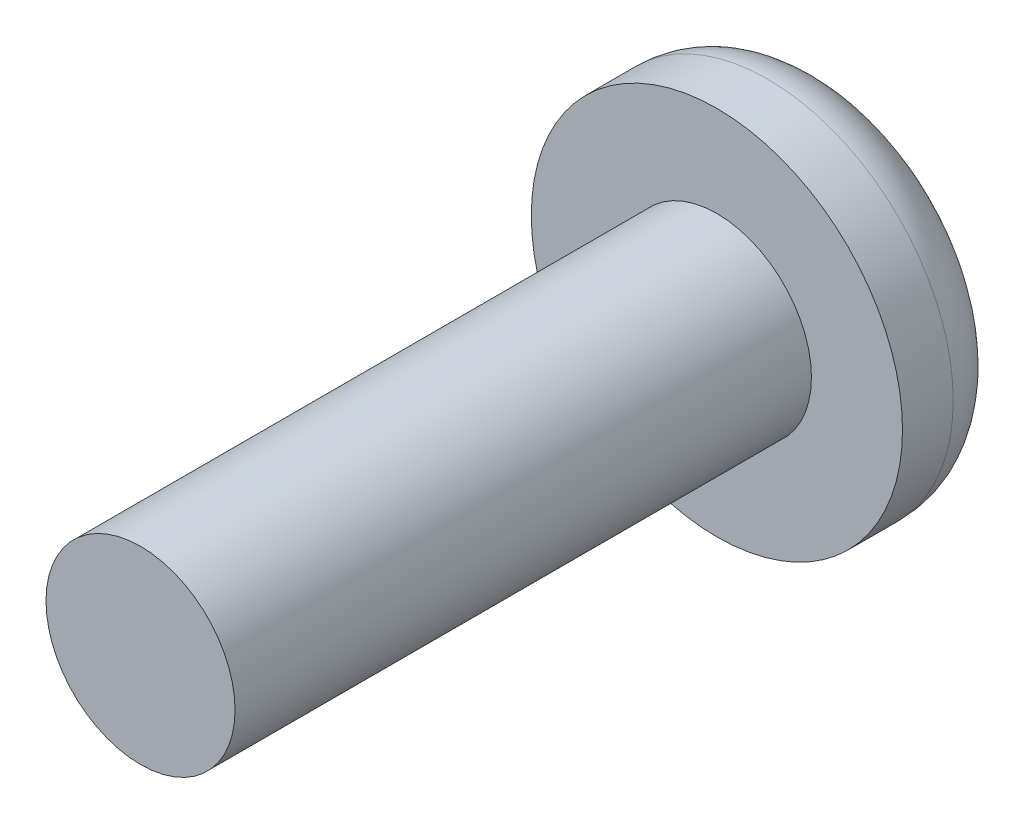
ISO-10303-21;
HEADER;
FILE_DESCRIPTION(('STEP AP214'),'2;1');
FILE_NAME('part.step','',(''),(''),'','','');
FILE_SCHEMA(('AUTOMOTIVE_DESIGN { 1 0 10303 214 1 1 1 1 }'));
ENDSEC;
DATA;
#1=APPLICATION_CONTEXT('core data for automotive mechanical design processes');
#2=APPLICATION_PROTOCOL_DEFINITION('international standard','automotive_design',2000,#1);
#3=PRODUCT_CONTEXT('',#1,'mechanical');
#4=PRODUCT('Part','Part','',(#3));
#5=PRODUCT_RELATED_PRODUCT_CATEGORY('part','',(#4));
#6=PRODUCT_DEFINITION_FORMATION('','',#4);
#7=PRODUCT_DEFINITION_CONTEXT('part definition',#1,'design');
#8=PRODUCT_DEFINITION('design','',#6,#7);
#9=PRODUCT_DEFINITION_SHAPE('','',#8);
#10=(LENGTH_UNIT() NAMED_UNIT(*) SI_UNIT(.MILLI.,.METRE.));
#11=(NAMED_UNIT(*) PLANE_ANGLE_UNIT() SI_UNIT($,.RADIAN.));
#12=(NAMED_UNIT(*) SI_UNIT($,.STERADIAN.) SOLID_ANGLE_UNIT());
#13=UNCERTAINTY_MEASURE_WITH_UNIT(LENGTH_MEASURE(1.E-05),#10,'distance_accuracy_value','');
#14=(GEOMETRIC_REPRESENTATION_CONTEXT(3) GLOBAL_UNCERTAINTY_ASSIGNED_CONTEXT((#13)) GLOBAL_UNIT_ASSIGNED_CONTEXT((#10,
#11,#12)) REPRESENTATION_CONTEXT('',''));
#15=CARTESIAN_POINT('',(0.,0.,0.));
#16=DIRECTION('',(0.,0.,1.));
#17=DIRECTION('',(1.,0.,0.));
#18=AXIS2_PLACEMENT_3D('',#15,#16,#17);
#19=CARTESIAN_POINT('',(0.,0.,-2.4384));
#20=DIRECTION('',(0.,0.,-1.));
#21=DIRECTION('',(-1.,0.,0.));
#22=AXIS2_PLACEMENT_3D('',#19,#20,#21);
#23=PLANE('',#22);
#24=CARTESIAN_POINT('',(0.,0.,-2.4384));
#25=DIRECTION('',(0.,0.,-1.));
#26=DIRECTION('',(-1.,0.,0.));
#27=AXIS2_PLACEMENT_3D('',#24,#25,#26);
#28=CIRCLE('',#27,2.7686);
#29=CARTESIAN_POINT('',(-2.7686,0.,-2.4384));
#30=VERTEX_POINT('',#29);
#31=EDGE_CURVE('E45',#30,#30,#28,.T.);
#32=ORIENTED_EDGE('',*,*,#31,.T.);
#33=EDGE_LOOP('',(#32));
#34=FACE_BOUND('',#33,.T.);
#35=DIRECTION('',(0.,-1.,0.));
#36=VECTOR('',#35,1.);
#37=CARTESIAN_POINT('',(2.0828,0.482599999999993,-2.43839999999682));
#38=LINE('',#37,#36);
#39=CARTESIAN_POINT('',(2.0828,0.482599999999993,-2.43839999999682));
#40=VERTEX_POINT('',#39);
#41=CARTESIAN_POINT('',(2.0828,-0.48260000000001,-2.43839999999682));
#42=VERTEX_POINT('',#41);
#43=EDGE_CURVE('E196',#40,#42,#38,.T.);
#44=ORIENTED_EDGE('',*,*,#43,.F.);
#45=DIRECTION('',(-1.,0.,0.));
#46=VECTOR('',#45,1.);
#47=CARTESIAN_POINT('',(2.0828,0.482599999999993,-2.43839999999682));
#48=LINE('',#47,#46);
#49=CARTESIAN_POINT('',(0.4826,0.4826,-2.43839999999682));
#50=VERTEX_POINT('',#49);
#51=EDGE_CURVE('E190',#40,#50,#48,.T.);
#52=ORIENTED_EDGE('',*,*,#51,.T.);
#53=DIRECTION('',(0.,1.,0.));
#54=VECTOR('',#53,1.);
#55=CARTESIAN_POINT('',(0.482599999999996,0.,-2.43839999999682));
#56=LINE('',#55,#54);
#57=CARTESIAN_POINT('',(0.4826,2.0828,-2.43839999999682));
#58=VERTEX_POINT('',#57);
#59=EDGE_CURVE('E65',#50,#58,#56,.T.);
#60=ORIENTED_EDGE('',*,*,#59,.T.);
#61=DIRECTION('',(1.,0.,0.));
#62=VECTOR('',#61,1.);
#63=CARTESIAN_POINT('',(-0.4826,2.08279999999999,-2.43839999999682));
#64=LINE('',#63,#62);
#65=CARTESIAN_POINT('',(-0.4826,2.08279999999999,-2.43839999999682));
#66=VERTEX_POINT('',#65);
#67=EDGE_CURVE('E217',#66,#58,#64,.T.);
#68=ORIENTED_EDGE('',*,*,#67,.F.);
#69=DIRECTION('',(0.,-1.,0.));
#70=VECTOR('',#69,1.);
#71=CARTESIAN_POINT('',(-0.4826,2.08279999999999,-2.43839999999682));
#72=LINE('',#71,#70);
#73=CARTESIAN_POINT('',(-0.482600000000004,0.482600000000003,-2.43839999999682));
#74=VERTEX_POINT('',#73);
#75=EDGE_CURVE('E211',#66,#74,#72,.T.);
#76=ORIENTED_EDGE('',*,*,#75,.T.);
#77=CARTESIAN_POINT('',(-2.0828,0.482600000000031,-2.43839999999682));
#78=VERTEX_POINT('',#77);
#79=EDGE_CURVE('E199',#74,#78,#48,.T.);
#80=ORIENTED_EDGE('',*,*,#79,.T.);
#81=DIRECTION('',(0.,1.,0.));
#82=VECTOR('',#81,1.);
#83=CARTESIAN_POINT('',(-2.08280000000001,-0.482599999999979,-2.43839999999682));
#84=LINE('',#83,#82);
#85=CARTESIAN_POINT('',(-2.08280000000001,-0.482599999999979,-2.43839999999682));
#86=VERTEX_POINT('',#85);
#87=EDGE_CURVE('E144',#86,#78,#84,.T.);
#88=ORIENTED_EDGE('',*,*,#87,.F.);
#89=DIRECTION('',(1.,0.,0.));
#90=VECTOR('',#89,1.);
#91=CARTESIAN_POINT('',(-2.08280000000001,-0.482599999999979,-2.43839999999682));
#92=LINE('',#91,#90);
#93=CARTESIAN_POINT('',(-0.482600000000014,-0.482599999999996,-2.43839999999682));
#94=VERTEX_POINT('',#93);
#95=EDGE_CURVE('E155',#86,#94,#92,.T.);
#96=ORIENTED_EDGE('',*,*,#95,.T.);
#97=DIRECTION('',(0.,-1.,0.));
#98=VECTOR('',#97,1.);
#99=CARTESIAN_POINT('',(-0.4826,0.,-2.43839999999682));
#100=LINE('',#99,#98);
#101=CARTESIAN_POINT('',(-0.482600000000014,-2.0828,-2.43839999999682));
#102=VERTEX_POINT('',#101);
#103=EDGE_CURVE('E164',#94,#102,#100,.T.);
#104=ORIENTED_EDGE('',*,*,#103,.T.);
#105=DIRECTION('',(-1.,0.,0.));
#106=VECTOR('',#105,1.);
#107=CARTESIAN_POINT('',(0.482599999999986,-2.08280000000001,-2.43839999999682));
#108=LINE('',#107,#106);
#109=CARTESIAN_POINT('',(0.482599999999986,-2.08280000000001,-2.43839999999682));
#110=VERTEX_POINT('',#109);
#111=EDGE_CURVE('E177',#110,#102,#108,.T.);
#112=ORIENTED_EDGE('',*,*,#111,.F.);
#113=DIRECTION('',(0.,1.,0.));
#114=VECTOR('',#113,1.);
#115=CARTESIAN_POINT('',(0.482599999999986,-2.08280000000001,-2.43839999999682));
#116=LINE('',#115,#114);
#117=CARTESIAN_POINT('',(0.482599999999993,-0.48260000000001,-2.43839999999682));
#118=VERTEX_POINT('',#117);
#119=EDGE_CURVE('E168',#110,#118,#116,.T.);
#120=ORIENTED_EDGE('',*,*,#119,.T.);
#121=DIRECTION('',(1.,0.,0.));
#122=VECTOR('',#121,1.);
#123=CARTESIAN_POINT('',(0.,-0.4826,-2.43839999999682));
#124=LINE('',#123,#122);
#125=EDGE_CURVE('E187',#118,#42,#124,.T.);
#126=ORIENTED_EDGE('',*,*,#125,.T.);
#127=EDGE_LOOP('',(#44,#52,#60,#68,#76,#80,#88,#96,#104,#112,#120,#126));
#128=FACE_BOUND('',#127,.T.);
#129=ADVANCED_FACE('F36',(#34,#128),#23,.T.);
#130=CARTESIAN_POINT('',(0.482599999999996,0.,-1.21919999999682));
#131=DIRECTION('',(-1.,0.,0.));
#132=DIRECTION('',(0.,-1.,0.));
#133=AXIS2_PLACEMENT_3D('',#130,#131,#132);
#134=PLANE('',#133);
#135=ORIENTED_EDGE('',*,*,#59,.F.);
#136=DIRECTION('',(0.,0.,1.));
#137=VECTOR('',#136,1.);
#138=CARTESIAN_POINT('',(0.4826,0.4826,-1.21919999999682));
#139=LINE('',#138,#137);
#140=CARTESIAN_POINT('',(0.4826,0.4826,-1.21919999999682));
#141=VERTEX_POINT('',#140);
#142=EDGE_CURVE('E205',#50,#141,#139,.T.);
#143=ORIENTED_EDGE('',*,*,#142,.T.);
#144=DIRECTION('',(0.,1.,0.));
#145=VECTOR('',#144,1.);
#146=CARTESIAN_POINT('',(0.482599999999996,0.,-1.21919999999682));
#147=LINE('',#146,#145);
#148=CARTESIAN_POINT('',(0.4826,2.0828,-1.21919999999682));
#149=VERTEX_POINT('',#148);
#150=EDGE_CURVE('E208',#141,#149,#147,.T.);
#151=ORIENTED_EDGE('',*,*,#150,.T.);
#152=DIRECTION('',(0.,0.,-1.));
#153=VECTOR('',#152,1.);
#154=CARTESIAN_POINT('',(0.4826,2.0828,-1.21919999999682));
#155=LINE('',#154,#153);
#156=EDGE_CURVE('E223',#149,#58,#155,.T.);
#157=ORIENTED_EDGE('',*,*,#156,.T.);
#158=EDGE_LOOP('',(#135,#143,#151,#157));
#159=FACE_BOUND('',#158,.T.);
#160=ADVANCED_FACE('F252',(#159),#134,.T.);
#161=CARTESIAN_POINT('',(-0.4826,2.08279999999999,-1.21919999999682));
#162=DIRECTION('',(1.,0.,0.));
#163=DIRECTION('',(0.,1.,0.));
#164=AXIS2_PLACEMENT_3D('',#161,#162,#163);
#165=PLANE('',#164);
#166=DIRECTION('',(0.,-1.,0.));
#167=VECTOR('',#166,1.);
#168=CARTESIAN_POINT('',(-0.4826,2.08279999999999,-1.21919999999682));
#169=LINE('',#168,#167);
#170=CARTESIAN_POINT('',(-0.4826,2.08279999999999,-1.21919999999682));
#171=VERTEX_POINT('',#170);
#172=CARTESIAN_POINT('',(-0.482600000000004,0.482600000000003,-1.21919999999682));
#173=VERTEX_POINT('',#172);
#174=EDGE_CURVE('E214',#171,#173,#169,.T.);
#175=ORIENTED_EDGE('',*,*,#174,.T.);
#176=DIRECTION('',(0.,0.,-1.));
#177=VECTOR('',#176,1.);
#178=CARTESIAN_POINT('',(-0.4826,0.48260000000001,-1.21919999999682));
#179=LINE('',#178,#177);
#180=EDGE_CURVE('E73',#173,#74,#179,.T.);
#181=ORIENTED_EDGE('',*,*,#180,.T.);
#182=ORIENTED_EDGE('',*,*,#75,.F.);
#183=DIRECTION('',(0.,0.,-1.));
#184=VECTOR('',#183,1.);
#185=CARTESIAN_POINT('',(-0.4826,2.08279999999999,-1.21919999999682));
#186=LINE('',#185,#184);
#187=EDGE_CURVE('E53',#171,#66,#186,.T.);
#188=ORIENTED_EDGE('',*,*,#187,.F.);
#189=EDGE_LOOP('',(#175,#181,#182,#188));
#190=FACE_BOUND('',#189,.T.);
#191=ADVANCED_FACE('F257',(#190),#165,.T.);
#192=CARTESIAN_POINT('',(0.,0.,12.7));
#193=DIRECTION('',(0.,0.,-1.));
#194=DIRECTION('',(-1.,0.,0.));
#195=AXIS2_PLACEMENT_3D('',#192,#193,#194);
#196=CYLINDRICAL_SURFACE('',#195,2.0828);
#197=CARTESIAN_POINT('',(0.,0.,12.7));
#198=DIRECTION('',(0.,0.,1.));
#199=DIRECTION('',(1.,0.,0.));
#200=AXIS2_PLACEMENT_3D('',#197,#198,#199);
#201=CIRCLE('',#200,2.0828);
#202=CARTESIAN_POINT('',(2.0828,0.,12.7));
#203=VERTEX_POINT('',#202);
#204=EDGE_CURVE('E231',#203,#203,#201,.T.);
#205=ORIENTED_EDGE('',*,*,#204,.F.);
#206=EDGE_LOOP('',(#205));
#207=FACE_BOUND('',#206,.T.);
#208=CARTESIAN_POINT('',(0.,0.,0.));
#209=DIRECTION('',(0.,0.,1.));
#210=DIRECTION('',(1.,0.,0.));
#211=AXIS2_PLACEMENT_3D('',#208,#209,#210);
#212=CIRCLE('',#211,2.0828);
#213=CARTESIAN_POINT('',(2.0828,0.,0.));
#214=VERTEX_POINT('',#213);
#215=EDGE_CURVE('E228',#214,#214,#212,.T.);
#216=ORIENTED_EDGE('',*,*,#215,.T.);
#217=EDGE_LOOP('',(#216));
#218=FACE_BOUND('',#217,.T.);
#219=ADVANCED_FACE('F266',(#207,#218),#196,.T.);
#220=CARTESIAN_POINT('',(0.,0.,12.7));
#221=DIRECTION('',(0.,0.,1.));
#222=DIRECTION('',(1.,0.,0.));
#223=AXIS2_PLACEMENT_3D('',#220,#221,#222);
#224=PLANE('',#223);
#225=ORIENTED_EDGE('',*,*,#204,.T.);
#226=EDGE_LOOP('',(#225));
#227=FACE_BOUND('',#226,.T.);
#228=ADVANCED_FACE('F263',(#227),#224,.T.);
#229=CARTESIAN_POINT('',(4.0894,0.,0.));
#230=DIRECTION('',(0.,0.,1.));
#231=DIRECTION('',(1.,0.,0.));
#232=AXIS2_PLACEMENT_3D('',#229,#230,#231);
#233=PLANE('',#232);
#234=ORIENTED_EDGE('',*,*,#215,.F.);
#235=EDGE_LOOP('',(#234));
#236=FACE_BOUND('',#235,.T.);
#237=CARTESIAN_POINT('',(0.,0.,0.));
#238=DIRECTION('',(0.,0.,-1.));
#239=DIRECTION('',(-1.,0.,0.));
#240=AXIS2_PLACEMENT_3D('',#237,#238,#239);
#241=CIRCLE('',#240,4.0894);
#242=CARTESIAN_POINT('',(-4.0894,0.,0.));
#243=VERTEX_POINT('',#242);
#244=EDGE_CURVE('E225',#243,#243,#241,.T.);
#245=ORIENTED_EDGE('',*,*,#244,.F.);
#246=EDGE_LOOP('',(#245));
#247=FACE_BOUND('',#246,.T.);
#248=ADVANCED_FACE('F247',(#236,#247),#233,.T.);
#249=CARTESIAN_POINT('',(0.,0.,-4.84031750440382));
#250=DIRECTION('',(0.,0.,-1.));
#251=DIRECTION('',(-1.,0.,0.));
#252=AXIS2_PLACEMENT_3D('',#249,#250,#251);
#253=CYLINDRICAL_SURFACE('',#252,4.0894);
#254=CARTESIAN_POINT('',(0.,0.,-1.1176));
#255=DIRECTION('',(0.,0.,-1.));
#256=DIRECTION('',(-1.,0.,0.));
#257=AXIS2_PLACEMENT_3D('',#254,#255,#256);
#258=CIRCLE('',#257,4.0894);
#259=CARTESIAN_POINT('',(-4.0894,0.,-1.1176));
#260=VERTEX_POINT('',#259);
#261=EDGE_CURVE('E11',#260,#260,#258,.F.);
#262=ORIENTED_EDGE('',*,*,#261,.T.);
#263=EDGE_LOOP('',(#262));
#264=FACE_BOUND('',#263,.T.);
#265=ORIENTED_EDGE('',*,*,#244,.T.);
#266=EDGE_LOOP('',(#265));
#267=FACE_BOUND('',#266,.T.);
#268=ADVANCED_FACE('F239',(#264,#267),#253,.T.);
#269=CARTESIAN_POINT('',(0.,0.,-1.1176));
#270=DIRECTION('',(0.,0.,-1.));
#271=DIRECTION('',(-1.,0.,0.));
#272=AXIS2_PLACEMENT_3D('',#269,#270,#271);
#273=TOROIDAL_SURFACE('',#272,2.7686,1.3208);
#274=ORIENTED_EDGE('',*,*,#261,.F.);
#275=EDGE_LOOP('',(#274));
#276=FACE_BOUND('',#275,.T.);
#277=ORIENTED_EDGE('',*,*,#31,.F.);
#278=EDGE_LOOP('',(#277));
#279=FACE_BOUND('',#278,.T.);
#280=ADVANCED_FACE('F38',(#276,#279),#273,.T.);
#281=CARTESIAN_POINT('',(-0.4826,2.08279999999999,-1.21919999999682));
#282=DIRECTION('',(0.,1.,0.));
#283=DIRECTION('',(0.,0.,1.));
#284=AXIS2_PLACEMENT_3D('',#281,#282,#283);
#285=PLANE('',#284);
#286=ORIENTED_EDGE('',*,*,#67,.T.);
#287=ORIENTED_EDGE('',*,*,#156,.F.);
#288=DIRECTION('',(1.,0.,0.));
#289=VECTOR('',#288,1.);
#290=CARTESIAN_POINT('',(-0.4826,2.08279999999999,-1.21919999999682));
#291=LINE('',#290,#289);
#292=EDGE_CURVE('E210',#171,#149,#291,.T.);
#293=ORIENTED_EDGE('',*,*,#292,.F.);
#294=ORIENTED_EDGE('',*,*,#187,.T.);
#295=EDGE_LOOP('',(#286,#287,#293,#294));
#296=FACE_BOUND('',#295,.T.);
#297=ADVANCED_FACE('F238',(#296),#285,.F.);
#298=CARTESIAN_POINT('',(0.482599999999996,0.,-1.21919999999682));
#299=DIRECTION('',(0.,0.,1.));
#300=DIRECTION('',(1.,0.,0.));
#301=AXIS2_PLACEMENT_3D('',#298,#299,#300);
#302=PLANE('',#301);
#303=ORIENTED_EDGE('',*,*,#150,.F.);
#304=DIRECTION('',(-1.,0.,0.));
#305=VECTOR('',#304,1.);
#306=CARTESIAN_POINT('',(2.0828,0.482599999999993,-1.21919999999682));
#307=LINE('',#306,#305);
#308=CARTESIAN_POINT('',(2.0828,0.482599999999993,-1.21919999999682));
#309=VERTEX_POINT('',#308);
#310=EDGE_CURVE('E136',#309,#141,#307,.T.);
#311=ORIENTED_EDGE('',*,*,#310,.F.);
#312=DIRECTION('',(0.,-1.,0.));
#313=VECTOR('',#312,1.);
#314=CARTESIAN_POINT('',(2.0828,0.482599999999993,-1.21919999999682));
#315=LINE('',#314,#313);
#316=CARTESIAN_POINT('',(2.0828,-0.48260000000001,-1.21919999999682));
#317=VERTEX_POINT('',#316);
#318=EDGE_CURVE('E137',#309,#317,#315,.T.);
#319=ORIENTED_EDGE('',*,*,#318,.T.);
#320=DIRECTION('',(1.,0.,0.));
#321=VECTOR('',#320,1.);
#322=CARTESIAN_POINT('',(0.,-0.4826,-1.21919999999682));
#323=LINE('',#322,#321);
#324=CARTESIAN_POINT('',(0.482599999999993,-0.48260000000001,-1.21919999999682));
#325=VERTEX_POINT('',#324);
#326=EDGE_CURVE('E188',#325,#317,#323,.T.);
#327=ORIENTED_EDGE('',*,*,#326,.F.);
#328=DIRECTION('',(0.,1.,0.));
#329=VECTOR('',#328,1.);
#330=CARTESIAN_POINT('',(0.482599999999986,-2.08280000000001,-1.21919999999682));
#331=LINE('',#330,#329);
#332=CARTESIAN_POINT('',(0.482599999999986,-2.08280000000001,-1.21919999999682));
#333=VERTEX_POINT('',#332);
#334=EDGE_CURVE('E171',#333,#325,#331,.T.);
#335=ORIENTED_EDGE('',*,*,#334,.F.);
#336=DIRECTION('',(-1.,0.,0.));
#337=VECTOR('',#336,1.);
#338=CARTESIAN_POINT('',(0.482599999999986,-2.08280000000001,-1.21919999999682));
#339=LINE('',#338,#337);
#340=CARTESIAN_POINT('',(-0.482600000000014,-2.0828,-1.21919999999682));
#341=VERTEX_POINT('',#340);
#342=EDGE_CURVE('E167',#333,#341,#339,.T.);
#343=ORIENTED_EDGE('',*,*,#342,.T.);
#344=DIRECTION('',(0.,-1.,0.));
#345=VECTOR('',#344,1.);
#346=CARTESIAN_POINT('',(-0.4826,0.,-1.21919999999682));
#347=LINE('',#346,#345);
#348=CARTESIAN_POINT('',(-0.482600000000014,-0.482599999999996,-1.21919999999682));
#349=VERTEX_POINT('',#348);
#350=EDGE_CURVE('E165',#349,#341,#347,.T.);
#351=ORIENTED_EDGE('',*,*,#350,.F.);
#352=DIRECTION('',(1.,0.,0.));
#353=VECTOR('',#352,1.);
#354=CARTESIAN_POINT('',(-2.08280000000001,-0.482599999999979,-1.21919999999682));
#355=LINE('',#354,#353);
#356=CARTESIAN_POINT('',(-2.08280000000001,-0.482599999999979,-1.21919999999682));
#357=VERTEX_POINT('',#356);
#358=EDGE_CURVE('E154',#357,#349,#355,.T.);
#359=ORIENTED_EDGE('',*,*,#358,.F.);
#360=DIRECTION('',(0.,1.,0.));
#361=VECTOR('',#360,1.);
#362=CARTESIAN_POINT('',(-2.08280000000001,-0.482599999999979,-1.21919999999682));
#363=LINE('',#362,#361);
#364=CARTESIAN_POINT('',(-2.0828,0.482600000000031,-1.21919999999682));
#365=VERTEX_POINT('',#364);
#366=EDGE_CURVE('E142',#357,#365,#363,.T.);
#367=ORIENTED_EDGE('',*,*,#366,.T.);
#368=EDGE_CURVE('E129',#173,#365,#307,.T.);
#369=ORIENTED_EDGE('',*,*,#368,.F.);
#370=ORIENTED_EDGE('',*,*,#174,.F.);
#371=ORIENTED_EDGE('',*,*,#292,.T.);
#372=EDGE_LOOP('',(#303,#311,#319,#327,#335,#343,#351,#359,#367,#369,#370,#371));
#373=FACE_BOUND('',#372,.T.);
#374=ADVANCED_FACE('F151',(#373),#302,.F.);
#375=CARTESIAN_POINT('',(2.0828,0.482599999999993,-1.21919999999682));
#376=DIRECTION('',(0.,-1.,0.));
#377=DIRECTION('',(1.,0.,0.));
#378=AXIS2_PLACEMENT_3D('',#375,#376,#377);
#379=PLANE('',#378);
#380=ORIENTED_EDGE('',*,*,#51,.F.);
#381=DIRECTION('',(0.,0.,-1.));
#382=VECTOR('',#381,1.);
#383=CARTESIAN_POINT('',(2.0828,0.482599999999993,-1.21919999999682));
#384=LINE('',#383,#382);
#385=EDGE_CURVE('E193',#309,#40,#384,.T.);
#386=ORIENTED_EDGE('',*,*,#385,.F.);
#387=ORIENTED_EDGE('',*,*,#310,.T.);
#388=ORIENTED_EDGE('',*,*,#142,.F.);
#389=EDGE_LOOP('',(#380,#386,#387,#388));
#390=FACE_BOUND('',#389,.T.);
#391=ADVANCED_FACE('F285',(#390),#379,.T.);
#392=CARTESIAN_POINT('',(0.,-0.4826,-1.21919999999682));
#393=DIRECTION('',(0.,1.,0.));
#394=DIRECTION('',(-1.,0.,0.));
#395=AXIS2_PLACEMENT_3D('',#392,#393,#394);
#396=PLANE('',#395);
#397=DIRECTION('',(0.,0.,1.));
#398=VECTOR('',#397,1.);
#399=CARTESIAN_POINT('',(0.482599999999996,-0.482600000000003,-1.21919999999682));
#400=LINE('',#399,#398);
#401=EDGE_CURVE('E185',#118,#325,#400,.T.);
#402=ORIENTED_EDGE('',*,*,#401,.T.);
#403=ORIENTED_EDGE('',*,*,#326,.T.);
#404=DIRECTION('',(0.,0.,-1.));
#405=VECTOR('',#404,1.);
#406=CARTESIAN_POINT('',(2.0828,-0.48260000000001,-1.21919999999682));
#407=LINE('',#406,#405);
#408=EDGE_CURVE('E202',#317,#42,#407,.T.);
#409=ORIENTED_EDGE('',*,*,#408,.T.);
#410=ORIENTED_EDGE('',*,*,#125,.F.);
#411=EDGE_LOOP('',(#402,#403,#409,#410));
#412=FACE_BOUND('',#411,.T.);
#413=ADVANCED_FACE('F286',(#412),#396,.T.);
#414=CARTESIAN_POINT('',(2.0828,0.482599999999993,-1.21919999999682));
#415=DIRECTION('',(1.,0.,0.));
#416=DIRECTION('',(0.,1.,0.));
#417=AXIS2_PLACEMENT_3D('',#414,#415,#416);
#418=PLANE('',#417);
#419=ORIENTED_EDGE('',*,*,#43,.T.);
#420=ORIENTED_EDGE('',*,*,#408,.F.);
#421=ORIENTED_EDGE('',*,*,#318,.F.);
#422=ORIENTED_EDGE('',*,*,#385,.T.);
#423=EDGE_LOOP('',(#419,#420,#421,#422));
#424=FACE_BOUND('',#423,.T.);
#425=ADVANCED_FACE('F289',(#424),#418,.F.);
#426=ORIENTED_EDGE('',*,*,#368,.T.);
#427=DIRECTION('',(0.,0.,-1.));
#428=VECTOR('',#427,1.);
#429=CARTESIAN_POINT('',(-2.0828,0.482600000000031,-1.21919999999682));
#430=LINE('',#429,#428);
#431=EDGE_CURVE('E132',#365,#78,#430,.T.);
#432=ORIENTED_EDGE('',*,*,#431,.T.);
#433=ORIENTED_EDGE('',*,*,#79,.F.);
#434=ORIENTED_EDGE('',*,*,#180,.F.);
#435=EDGE_LOOP('',(#426,#432,#433,#434));
#436=FACE_BOUND('',#435,.T.);
#437=ADVANCED_FACE('F131',(#436),#379,.T.);
#438=CARTESIAN_POINT('',(0.482599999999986,-2.08280000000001,-1.21919999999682));
#439=DIRECTION('',(-1.,0.,0.));
#440=DIRECTION('',(0.,-1.,0.));
#441=AXIS2_PLACEMENT_3D('',#438,#439,#440);
#442=PLANE('',#441);
#443=ORIENTED_EDGE('',*,*,#119,.F.);
#444=DIRECTION('',(0.,0.,-1.));
#445=VECTOR('',#444,1.);
#446=CARTESIAN_POINT('',(0.482599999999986,-2.08280000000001,-1.21919999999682));
#447=LINE('',#446,#445);
#448=EDGE_CURVE('E174',#333,#110,#447,.T.);
#449=ORIENTED_EDGE('',*,*,#448,.F.);
#450=ORIENTED_EDGE('',*,*,#334,.T.);
#451=ORIENTED_EDGE('',*,*,#401,.F.);
#452=EDGE_LOOP('',(#443,#449,#450,#451));
#453=FACE_BOUND('',#452,.T.);
#454=ADVANCED_FACE('F296',(#453),#442,.T.);
#455=CARTESIAN_POINT('',(-0.4826,0.,-1.21919999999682));
#456=DIRECTION('',(1.,0.,0.));
#457=DIRECTION('',(0.,1.,0.));
#458=AXIS2_PLACEMENT_3D('',#455,#456,#457);
#459=PLANE('',#458);
#460=DIRECTION('',(0.,0.,1.));
#461=VECTOR('',#460,1.);
#462=CARTESIAN_POINT('',(-0.482600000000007,-0.482600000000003,-1.21919999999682));
#463=LINE('',#462,#461);
#464=EDGE_CURVE('E146',#94,#349,#463,.T.);
#465=ORIENTED_EDGE('',*,*,#464,.T.);
#466=ORIENTED_EDGE('',*,*,#350,.T.);
#467=DIRECTION('',(0.,0.,-1.));
#468=VECTOR('',#467,1.);
#469=CARTESIAN_POINT('',(-0.482600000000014,-2.0828,-1.21919999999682));
#470=LINE('',#469,#468);
#471=EDGE_CURVE('E183',#341,#102,#470,.T.);
#472=ORIENTED_EDGE('',*,*,#471,.T.);
#473=ORIENTED_EDGE('',*,*,#103,.F.);
#474=EDGE_LOOP('',(#465,#466,#472,#473));
#475=FACE_BOUND('',#474,.T.);
#476=ADVANCED_FACE('F297',(#475),#459,.T.);
#477=CARTESIAN_POINT('',(0.482599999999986,-2.08280000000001,-1.21919999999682));
#478=DIRECTION('',(0.,-1.,0.));
#479=DIRECTION('',(1.,0.,0.));
#480=AXIS2_PLACEMENT_3D('',#477,#478,#479);
#481=PLANE('',#480);
#482=ORIENTED_EDGE('',*,*,#111,.T.);
#483=ORIENTED_EDGE('',*,*,#471,.F.);
#484=ORIENTED_EDGE('',*,*,#342,.F.);
#485=ORIENTED_EDGE('',*,*,#448,.T.);
#486=EDGE_LOOP('',(#482,#483,#484,#485));
#487=FACE_BOUND('',#486,.T.);
#488=ADVANCED_FACE('F300',(#487),#481,.F.);
#489=CARTESIAN_POINT('',(-2.08280000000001,-0.482599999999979,-1.21919999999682));
#490=DIRECTION('',(0.,1.,0.));
#491=DIRECTION('',(-1.,0.,0.));
#492=AXIS2_PLACEMENT_3D('',#489,#490,#491);
#493=PLANE('',#492);
#494=ORIENTED_EDGE('',*,*,#95,.F.);
#495=DIRECTION('',(0.,0.,-1.));
#496=VECTOR('',#495,1.);
#497=CARTESIAN_POINT('',(-2.08280000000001,-0.482599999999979,-1.21919999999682));
#498=LINE('',#497,#496);
#499=EDGE_CURVE('E147',#357,#86,#498,.T.);
#500=ORIENTED_EDGE('',*,*,#499,.F.);
#501=ORIENTED_EDGE('',*,*,#358,.T.);
#502=ORIENTED_EDGE('',*,*,#464,.F.);
#503=EDGE_LOOP('',(#494,#500,#501,#502));
#504=FACE_BOUND('',#503,.T.);
#505=ADVANCED_FACE('F304',(#504),#493,.T.);
#506=CARTESIAN_POINT('',(-2.08280000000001,-0.482599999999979,-1.21919999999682));
#507=DIRECTION('',(-1.,0.,0.));
#508=DIRECTION('',(0.,-1.,0.));
#509=AXIS2_PLACEMENT_3D('',#506,#507,#508);
#510=PLANE('',#509);
#511=ORIENTED_EDGE('',*,*,#87,.T.);
#512=ORIENTED_EDGE('',*,*,#431,.F.);
#513=ORIENTED_EDGE('',*,*,#366,.F.);
#514=ORIENTED_EDGE('',*,*,#499,.T.);
#515=EDGE_LOOP('',(#511,#512,#513,#514));
#516=FACE_BOUND('',#515,.T.);
#517=ADVANCED_FACE('F141',(#516),#510,.F.);
#518=CLOSED_SHELL('',(#129,#160,#191,#219,#228,#248,#268,#280,#297,#374,#391,#413,#425,#437,
#454,#476,#488,#505,#517));
#519=MANIFOLD_SOLID_BREP('B2',#518);
#520=ADVANCED_BREP_SHAPE_REPRESENTATION('',(#18,#519),#14);
#521=SHAPE_DEFINITION_REPRESENTATION(#9,#520);
ENDSEC;
END-ISO-10303-21;
